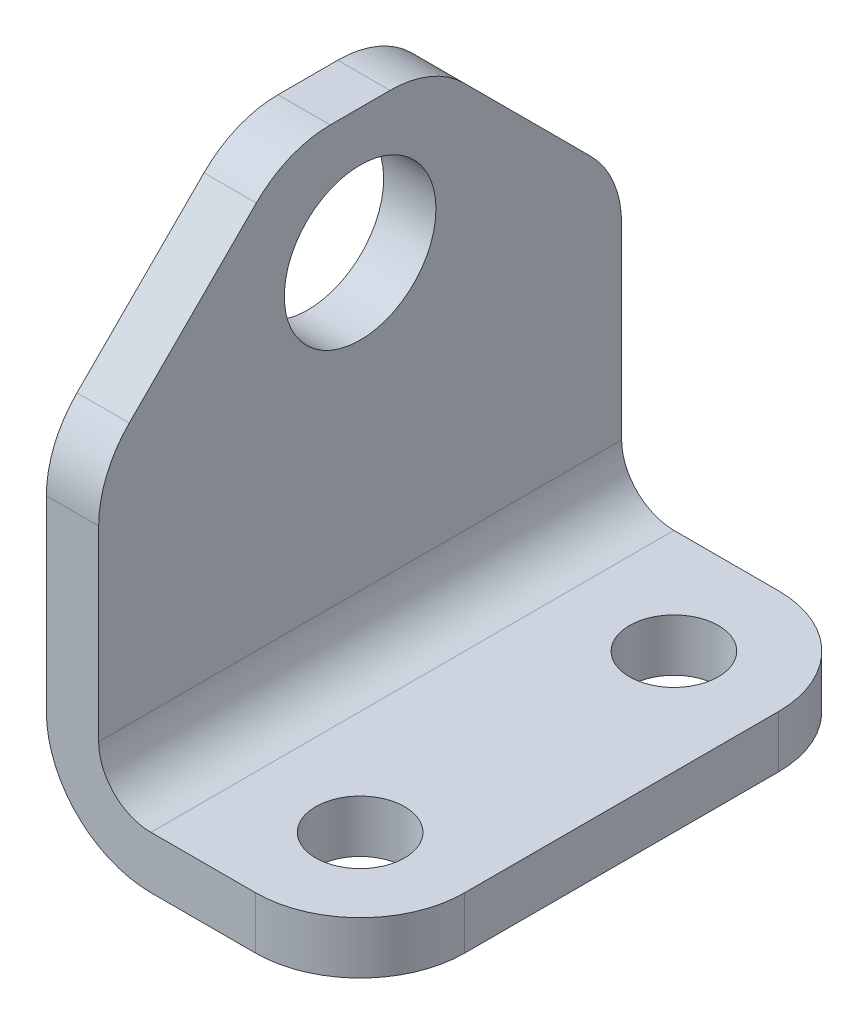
ISO-10303-21;
HEADER;
FILE_DESCRIPTION(('STEP AP214'),'2;1');
FILE_NAME('part.step','',(''),(''),'','','');
FILE_SCHEMA(('AUTOMOTIVE_DESIGN { 1 0 10303 214 1 1 1 1 }'));
ENDSEC;
DATA;
#1=APPLICATION_CONTEXT('core data for automotive mechanical design processes');
#2=APPLICATION_PROTOCOL_DEFINITION('international standard','automotive_design',2000,#1);
#3=PRODUCT_CONTEXT('',#1,'mechanical');
#4=PRODUCT('Part','Part','',(#3));
#5=PRODUCT_RELATED_PRODUCT_CATEGORY('part','',(#4));
#6=PRODUCT_DEFINITION_FORMATION('','',#4);
#7=PRODUCT_DEFINITION_CONTEXT('part definition',#1,'design');
#8=PRODUCT_DEFINITION('design','',#6,#7);
#9=PRODUCT_DEFINITION_SHAPE('','',#8);
#10=(LENGTH_UNIT() NAMED_UNIT(*) SI_UNIT(.MILLI.,.METRE.));
#11=(NAMED_UNIT(*) PLANE_ANGLE_UNIT() SI_UNIT($,.RADIAN.));
#12=(NAMED_UNIT(*) SI_UNIT($,.STERADIAN.) SOLID_ANGLE_UNIT());
#13=UNCERTAINTY_MEASURE_WITH_UNIT(LENGTH_MEASURE(1.E-05),#10,'distance_accuracy_value','');
#14=(GEOMETRIC_REPRESENTATION_CONTEXT(3) GLOBAL_UNCERTAINTY_ASSIGNED_CONTEXT((#13)) GLOBAL_UNIT_ASSIGNED_CONTEXT((#10,
#11,#12)) REPRESENTATION_CONTEXT('',''));
#15=CARTESIAN_POINT('',(0.,0.,0.));
#16=DIRECTION('',(0.,0.,1.));
#17=DIRECTION('',(1.,0.,0.));
#18=AXIS2_PLACEMENT_3D('',#15,#16,#17);
#19=CARTESIAN_POINT('',(0.,50.,50.));
#20=DIRECTION('',(1.,0.,0.));
#21=DIRECTION('',(0.,1.,0.));
#22=AXIS2_PLACEMENT_3D('',#19,#20,#21);
#23=PLANE('',#22);
#24=CARTESIAN_POINT('',(0.,38.,25.));
#25=DIRECTION('',(1.,0.,0.));
#26=DIRECTION('',(0.,0.,-1.));
#27=AXIS2_PLACEMENT_3D('',#24,#25,#26);
#28=CIRCLE('',#27,7.24999999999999);
#29=CARTESIAN_POINT('',(0.,38.,17.75));
#30=VERTEX_POINT('',#29);
#31=EDGE_CURVE('E324',#30,#30,#28,.T.);
#32=ORIENTED_EDGE('',*,*,#31,.T.);
#33=EDGE_LOOP('',(#32));
#34=FACE_BOUND('',#33,.T.);
#35=DIRECTION('',(0.,-1.,0.));
#36=VECTOR('',#35,1.);
#37=CARTESIAN_POINT('',(0.,50.,50.));
#38=LINE('',#37,#36);
#39=CARTESIAN_POINT('',(0.,27.8578643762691,50.));
#40=VERTEX_POINT('',#39);
#41=CARTESIAN_POINT('',(0.,9.99999999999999,50.));
#42=VERTEX_POINT('',#41);
#43=EDGE_CURVE('E177',#40,#42,#38,.T.);
#44=ORIENTED_EDGE('',*,*,#43,.F.);
#45=CARTESIAN_POINT('',(0.,27.8578643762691,40.));
#46=DIRECTION('',(1.,0.,0.));
#47=DIRECTION('',(0.,1.,0.));
#48=AXIS2_PLACEMENT_3D('',#45,#46,#47);
#49=CIRCLE('',#48,10.);
#50=CARTESIAN_POINT('',(0.,34.9289321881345,47.0710678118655));
#51=VERTEX_POINT('',#50);
#52=EDGE_CURVE('E256',#40,#51,#49,.F.);
#53=ORIENTED_EDGE('',*,*,#52,.T.);
#54=DIRECTION('',(0.,0.707106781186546,-0.707106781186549));
#55=VECTOR('',#54,1.);
#56=CARTESIAN_POINT('',(0.,32.,50.));
#57=LINE('',#56,#55);
#58=CARTESIAN_POINT('',(0.,47.0710678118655,34.9289321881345));
#59=VERTEX_POINT('',#58);
#60=EDGE_CURVE('E209',#51,#59,#57,.T.);
#61=ORIENTED_EDGE('',*,*,#60,.T.);
#62=CARTESIAN_POINT('',(0.,40.,27.857864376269));
#63=DIRECTION('',(1.,0.,0.));
#64=DIRECTION('',(0.,1.,0.));
#65=AXIS2_PLACEMENT_3D('',#62,#63,#64);
#66=CIRCLE('',#65,10.);
#67=CARTESIAN_POINT('',(0.,50.,27.857864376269));
#68=VERTEX_POINT('',#67);
#69=EDGE_CURVE('E250',#59,#68,#66,.F.);
#70=ORIENTED_EDGE('',*,*,#69,.T.);
#71=DIRECTION('',(0.,0.,-1.));
#72=VECTOR('',#71,1.);
#73=CARTESIAN_POINT('',(0.,50.,50.));
#74=LINE('',#73,#72);
#75=CARTESIAN_POINT('',(0.,50.,22.142135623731));
#76=VERTEX_POINT('',#75);
#77=EDGE_CURVE('E186',#68,#76,#74,.T.);
#78=ORIENTED_EDGE('',*,*,#77,.T.);
#79=CARTESIAN_POINT('',(0.,40.,22.142135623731));
#80=DIRECTION('',(1.,0.,0.));
#81=DIRECTION('',(0.,1.,0.));
#82=AXIS2_PLACEMENT_3D('',#79,#80,#81);
#83=CIRCLE('',#82,10.);
#84=CARTESIAN_POINT('',(0.,47.0710678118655,15.0710678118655));
#85=VERTEX_POINT('',#84);
#86=EDGE_CURVE('E252',#76,#85,#83,.F.);
#87=ORIENTED_EDGE('',*,*,#86,.T.);
#88=DIRECTION('',(0.,0.707106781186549,0.707106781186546));
#89=VECTOR('',#88,1.);
#90=CARTESIAN_POINT('',(0.,50.,18.));
#91=LINE('',#90,#89);
#92=CARTESIAN_POINT('',(0.,34.9289321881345,2.92893218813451));
#93=VERTEX_POINT('',#92);
#94=EDGE_CURVE('E221',#85,#93,#91,.F.);
#95=ORIENTED_EDGE('',*,*,#94,.T.);
#96=CARTESIAN_POINT('',(0.,27.857864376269,10.));
#97=DIRECTION('',(1.,0.,0.));
#98=DIRECTION('',(0.,1.,0.));
#99=AXIS2_PLACEMENT_3D('',#96,#97,#98);
#100=CIRCLE('',#99,10.);
#101=CARTESIAN_POINT('',(0.,27.857864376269,0.));
#102=VERTEX_POINT('',#101);
#103=EDGE_CURVE('E254',#93,#102,#100,.F.);
#104=ORIENTED_EDGE('',*,*,#103,.T.);
#105=DIRECTION('',(0.,-1.,0.));
#106=VECTOR('',#105,1.);
#107=CARTESIAN_POINT('',(0.,50.,0.));
#108=LINE('',#107,#106);
#109=CARTESIAN_POINT('',(0.,9.99999999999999,0.));
#110=VERTEX_POINT('',#109);
#111=EDGE_CURVE('E213',#102,#110,#108,.T.);
#112=ORIENTED_EDGE('',*,*,#111,.T.);
#113=DIRECTION('',(0.,0.,-1.));
#114=VECTOR('',#113,1.);
#115=CARTESIAN_POINT('',(0.,9.99999999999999,50.));
#116=LINE('',#115,#114);
#117=EDGE_CURVE('E204',#110,#42,#116,.F.);
#118=ORIENTED_EDGE('',*,*,#117,.T.);
#119=EDGE_LOOP('',(#44,#53,#61,#70,#78,#87,#95,#104,#112,#118));
#120=FACE_BOUND('',#119,.T.);
#121=ADVANCED_FACE('F34',(#34,#120),#23,.F.);
#122=CARTESIAN_POINT('',(0.,0.,50.));
#123=DIRECTION('',(0.,1.,0.));
#124=DIRECTION('',(0.,0.,1.));
#125=AXIS2_PLACEMENT_3D('',#122,#123,#124);
#126=PLANE('',#125);
#127=CARTESIAN_POINT('',(20.,0.,10.));
#128=DIRECTION('',(0.,-1.,0.));
#129=DIRECTION('',(0.,0.,-1.));
#130=AXIS2_PLACEMENT_3D('',#127,#128,#129);
#131=CIRCLE('',#130,4.25);
#132=CARTESIAN_POINT('',(20.,0.,5.75));
#133=VERTEX_POINT('',#132);
#134=EDGE_CURVE('E218',#133,#133,#131,.T.);
#135=ORIENTED_EDGE('',*,*,#134,.F.);
#136=EDGE_LOOP('',(#135));
#137=FACE_BOUND('',#136,.T.);
#138=CARTESIAN_POINT('',(20.,0.,40.));
#139=DIRECTION('',(0.,-1.,0.));
#140=DIRECTION('',(0.,0.,-1.));
#141=AXIS2_PLACEMENT_3D('',#138,#139,#140);
#142=CIRCLE('',#141,4.25);
#143=CARTESIAN_POINT('',(20.,0.,35.75));
#144=VERTEX_POINT('',#143);
#145=EDGE_CURVE('E214',#144,#144,#142,.T.);
#146=ORIENTED_EDGE('',*,*,#145,.F.);
#147=EDGE_LOOP('',(#146));
#148=FACE_BOUND('',#147,.T.);
#149=DIRECTION('',(1.,0.,0.));
#150=VECTOR('',#149,1.);
#151=CARTESIAN_POINT('',(0.,0.,0.));
#152=LINE('',#151,#150);
#153=CARTESIAN_POINT('',(10.,0.,0.));
#154=VERTEX_POINT('',#153);
#155=CARTESIAN_POINT('',(20.,0.,0.));
#156=VERTEX_POINT('',#155);
#157=EDGE_CURVE('E182',#154,#156,#152,.T.);
#158=ORIENTED_EDGE('',*,*,#157,.T.);
#159=CARTESIAN_POINT('',(20.,0.,10.));
#160=DIRECTION('',(0.,1.,0.));
#161=DIRECTION('',(0.,0.,1.));
#162=AXIS2_PLACEMENT_3D('',#159,#160,#161);
#163=CIRCLE('',#162,10.);
#164=CARTESIAN_POINT('',(30.,0.,10.));
#165=VERTEX_POINT('',#164);
#166=EDGE_CURVE('E242',#156,#165,#163,.F.);
#167=ORIENTED_EDGE('',*,*,#166,.T.);
#168=DIRECTION('',(0.,0.,-1.));
#169=VECTOR('',#168,1.);
#170=CARTESIAN_POINT('',(30.,0.,50.));
#171=LINE('',#170,#169);
#172=CARTESIAN_POINT('',(30.,0.,40.));
#173=VERTEX_POINT('',#172);
#174=EDGE_CURVE('E170',#173,#165,#171,.T.);
#175=ORIENTED_EDGE('',*,*,#174,.F.);
#176=CARTESIAN_POINT('',(20.,0.,40.));
#177=DIRECTION('',(0.,1.,0.));
#178=DIRECTION('',(0.,0.,1.));
#179=AXIS2_PLACEMENT_3D('',#176,#177,#178);
#180=CIRCLE('',#179,10.);
#181=CARTESIAN_POINT('',(20.,0.,50.));
#182=VERTEX_POINT('',#181);
#183=EDGE_CURVE('E240',#173,#182,#180,.F.);
#184=ORIENTED_EDGE('',*,*,#183,.T.);
#185=DIRECTION('',(1.,0.,0.));
#186=VECTOR('',#185,1.);
#187=CARTESIAN_POINT('',(0.,0.,50.));
#188=LINE('',#187,#186);
#189=CARTESIAN_POINT('',(10.,0.,50.));
#190=VERTEX_POINT('',#189);
#191=EDGE_CURVE('E180',#190,#182,#188,.T.);
#192=ORIENTED_EDGE('',*,*,#191,.F.);
#193=DIRECTION('',(0.,0.,-1.));
#194=VECTOR('',#193,1.);
#195=CARTESIAN_POINT('',(10.,0.,50.));
#196=LINE('',#195,#194);
#197=EDGE_CURVE('E198',#190,#154,#196,.T.);
#198=ORIENTED_EDGE('',*,*,#197,.T.);
#199=EDGE_LOOP('',(#158,#167,#175,#184,#192,#198));
#200=FACE_BOUND('',#199,.T.);
#201=ADVANCED_FACE('F299',(#137,#148,#200),#126,.F.);
#202=CARTESIAN_POINT('',(30.,5.,50.));
#203=DIRECTION('',(-1.,0.,0.));
#204=DIRECTION('',(0.,-1.,0.));
#205=AXIS2_PLACEMENT_3D('',#202,#203,#204);
#206=PLANE('',#205);
#207=ORIENTED_EDGE('',*,*,#174,.T.);
#208=DIRECTION('',(0.,1.,0.));
#209=VECTOR('',#208,1.);
#210=CARTESIAN_POINT('',(30.,5.,10.));
#211=LINE('',#210,#209);
#212=CARTESIAN_POINT('',(30.,5.,10.));
#213=VERTEX_POINT('',#212);
#214=EDGE_CURVE('E230',#165,#213,#211,.T.);
#215=ORIENTED_EDGE('',*,*,#214,.T.);
#216=DIRECTION('',(0.,0.,-1.));
#217=VECTOR('',#216,1.);
#218=CARTESIAN_POINT('',(30.,5.,50.));
#219=LINE('',#218,#217);
#220=CARTESIAN_POINT('',(30.,5.,40.));
#221=VERTEX_POINT('',#220);
#222=EDGE_CURVE('E191',#221,#213,#219,.T.);
#223=ORIENTED_EDGE('',*,*,#222,.F.);
#224=DIRECTION('',(0.,1.,0.));
#225=VECTOR('',#224,1.);
#226=CARTESIAN_POINT('',(30.,0.,40.));
#227=LINE('',#226,#225);
#228=EDGE_CURVE('E228',#221,#173,#227,.F.);
#229=ORIENTED_EDGE('',*,*,#228,.T.);
#230=EDGE_LOOP('',(#207,#215,#223,#229));
#231=FACE_BOUND('',#230,.T.);
#232=ADVANCED_FACE('F309',(#231),#206,.F.);
#233=CARTESIAN_POINT('',(5.,5.,50.));
#234=DIRECTION('',(0.,-1.,0.));
#235=DIRECTION('',(0.,0.,-1.));
#236=AXIS2_PLACEMENT_3D('',#233,#234,#235);
#237=PLANE('',#236);
#238=CARTESIAN_POINT('',(20.,5.,10.));
#239=DIRECTION('',(0.,-1.,0.));
#240=DIRECTION('',(0.,0.,-1.));
#241=AXIS2_PLACEMENT_3D('',#238,#239,#240);
#242=CIRCLE('',#241,4.25);
#243=CARTESIAN_POINT('',(20.,5.,5.75));
#244=VERTEX_POINT('',#243);
#245=EDGE_CURVE('E215',#244,#244,#242,.T.);
#246=ORIENTED_EDGE('',*,*,#245,.T.);
#247=EDGE_LOOP('',(#246));
#248=FACE_BOUND('',#247,.T.);
#249=CARTESIAN_POINT('',(20.,5.,40.));
#250=DIRECTION('',(0.,-1.,0.));
#251=DIRECTION('',(0.,0.,-1.));
#252=AXIS2_PLACEMENT_3D('',#249,#250,#251);
#253=CIRCLE('',#252,4.25);
#254=CARTESIAN_POINT('',(20.,5.,35.75));
#255=VERTEX_POINT('',#254);
#256=EDGE_CURVE('E210',#255,#255,#253,.T.);
#257=ORIENTED_EDGE('',*,*,#256,.T.);
#258=EDGE_LOOP('',(#257));
#259=FACE_BOUND('',#258,.T.);
#260=ORIENTED_EDGE('',*,*,#222,.T.);
#261=CARTESIAN_POINT('',(20.,5.,10.));
#262=DIRECTION('',(0.,-1.,0.));
#263=DIRECTION('',(0.,0.,-1.));
#264=AXIS2_PLACEMENT_3D('',#261,#262,#263);
#265=CIRCLE('',#264,10.);
#266=CARTESIAN_POINT('',(20.,5.,0.));
#267=VERTEX_POINT('',#266);
#268=EDGE_CURVE('E235',#213,#267,#265,.F.);
#269=ORIENTED_EDGE('',*,*,#268,.T.);
#270=DIRECTION('',(-1.,0.,0.));
#271=VECTOR('',#270,1.);
#272=CARTESIAN_POINT('',(5.,5.,0.));
#273=LINE('',#272,#271);
#274=CARTESIAN_POINT('',(10.,5.,0.));
#275=VERTEX_POINT('',#274);
#276=EDGE_CURVE('E178',#267,#275,#273,.T.);
#277=ORIENTED_EDGE('',*,*,#276,.T.);
#278=DIRECTION('',(0.,0.,-1.));
#279=VECTOR('',#278,1.);
#280=CARTESIAN_POINT('',(10.,5.,50.));
#281=LINE('',#280,#279);
#282=CARTESIAN_POINT('',(10.,5.,50.));
#283=VERTEX_POINT('',#282);
#284=EDGE_CURVE('E157',#275,#283,#281,.F.);
#285=ORIENTED_EDGE('',*,*,#284,.T.);
#286=DIRECTION('',(-1.,0.,0.));
#287=VECTOR('',#286,1.);
#288=CARTESIAN_POINT('',(5.,5.,50.));
#289=LINE('',#288,#287);
#290=CARTESIAN_POINT('',(20.,5.,50.));
#291=VERTEX_POINT('',#290);
#292=EDGE_CURVE('E290',#291,#283,#289,.T.);
#293=ORIENTED_EDGE('',*,*,#292,.F.);
#294=CARTESIAN_POINT('',(20.,5.,40.));
#295=DIRECTION('',(0.,-1.,0.));
#296=DIRECTION('',(0.,0.,-1.));
#297=AXIS2_PLACEMENT_3D('',#294,#295,#296);
#298=CIRCLE('',#297,10.);
#299=EDGE_CURVE('E233',#291,#221,#298,.F.);
#300=ORIENTED_EDGE('',*,*,#299,.T.);
#301=EDGE_LOOP('',(#260,#269,#277,#285,#293,#300));
#302=FACE_BOUND('',#301,.T.);
#303=ADVANCED_FACE('F312',(#248,#259,#302),#237,.F.);
#304=CARTESIAN_POINT('',(4.99999999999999,50.,50.));
#305=DIRECTION('',(-1.,0.,0.));
#306=DIRECTION('',(0.,-1.,0.));
#307=AXIS2_PLACEMENT_3D('',#304,#305,#306);
#308=PLANE('',#307);
#309=CARTESIAN_POINT('',(5.,38.,25.));
#310=DIRECTION('',(1.,0.,0.));
#311=DIRECTION('',(0.,0.,-1.));
#312=AXIS2_PLACEMENT_3D('',#309,#310,#311);
#313=CIRCLE('',#312,7.24999999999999);
#314=CARTESIAN_POINT('',(5.,38.,17.75));
#315=VERTEX_POINT('',#314);
#316=EDGE_CURVE('E327',#315,#315,#313,.T.);
#317=ORIENTED_EDGE('',*,*,#316,.F.);
#318=EDGE_LOOP('',(#317));
#319=FACE_BOUND('',#318,.T.);
#320=DIRECTION('',(0.,-0.707106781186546,0.707106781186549));
#321=VECTOR('',#320,1.);
#322=CARTESIAN_POINT('',(5.,32.,50.));
#323=LINE('',#322,#321);
#324=CARTESIAN_POINT('',(4.99999999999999,47.0710678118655,34.9289321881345));
#325=VERTEX_POINT('',#324);
#326=CARTESIAN_POINT('',(5.,34.9289321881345,47.0710678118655));
#327=VERTEX_POINT('',#326);
#328=EDGE_CURVE('E224',#325,#327,#323,.T.);
#329=ORIENTED_EDGE('',*,*,#328,.T.);
#330=CARTESIAN_POINT('',(5.,27.8578643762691,40.));
#331=DIRECTION('',(-1.,0.,0.));
#332=DIRECTION('',(0.,-1.,0.));
#333=AXIS2_PLACEMENT_3D('',#330,#331,#332);
#334=CIRCLE('',#333,10.);
#335=CARTESIAN_POINT('',(5.,27.8578643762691,50.));
#336=VERTEX_POINT('',#335);
#337=EDGE_CURVE('E266',#327,#336,#334,.F.);
#338=ORIENTED_EDGE('',*,*,#337,.T.);
#339=DIRECTION('',(0.,1.,0.));
#340=VECTOR('',#339,1.);
#341=CARTESIAN_POINT('',(4.99999999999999,50.,50.));
#342=LINE('',#341,#340);
#343=CARTESIAN_POINT('',(5.,10.,50.));
#344=VERTEX_POINT('',#343);
#345=EDGE_CURVE('E169',#344,#336,#342,.T.);
#346=ORIENTED_EDGE('',*,*,#345,.F.);
#347=DIRECTION('',(0.,0.,-1.));
#348=VECTOR('',#347,1.);
#349=CARTESIAN_POINT('',(5.,10.,0.));
#350=LINE('',#349,#348);
#351=CARTESIAN_POINT('',(5.,10.,0.));
#352=VERTEX_POINT('',#351);
#353=EDGE_CURVE('E155',#344,#352,#350,.T.);
#354=ORIENTED_EDGE('',*,*,#353,.T.);
#355=DIRECTION('',(0.,1.,0.));
#356=VECTOR('',#355,1.);
#357=CARTESIAN_POINT('',(4.99999999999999,50.,0.));
#358=LINE('',#357,#356);
#359=CARTESIAN_POINT('',(5.,27.857864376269,0.));
#360=VERTEX_POINT('',#359);
#361=EDGE_CURVE('E167',#352,#360,#358,.T.);
#362=ORIENTED_EDGE('',*,*,#361,.T.);
#363=CARTESIAN_POINT('',(5.,27.857864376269,10.));
#364=DIRECTION('',(-1.,0.,0.));
#365=DIRECTION('',(0.,-1.,0.));
#366=AXIS2_PLACEMENT_3D('',#363,#364,#365);
#367=CIRCLE('',#366,10.);
#368=CARTESIAN_POINT('',(5.,34.9289321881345,2.92893218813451));
#369=VERTEX_POINT('',#368);
#370=EDGE_CURVE('E264',#360,#369,#367,.F.);
#371=ORIENTED_EDGE('',*,*,#370,.T.);
#372=DIRECTION('',(0.,-0.707106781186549,-0.707106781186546));
#373=VECTOR('',#372,1.);
#374=CARTESIAN_POINT('',(4.99999999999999,50.,18.));
#375=LINE('',#374,#373);
#376=CARTESIAN_POINT('',(4.99999999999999,47.0710678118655,15.0710678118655));
#377=VERTEX_POINT('',#376);
#378=EDGE_CURVE('E226',#369,#377,#375,.F.);
#379=ORIENTED_EDGE('',*,*,#378,.T.);
#380=CARTESIAN_POINT('',(4.99999999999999,40.,22.142135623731));
#381=DIRECTION('',(-1.,0.,0.));
#382=DIRECTION('',(0.,-1.,0.));
#383=AXIS2_PLACEMENT_3D('',#380,#381,#382);
#384=CIRCLE('',#383,10.);
#385=CARTESIAN_POINT('',(4.99999999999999,50.,22.142135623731));
#386=VERTEX_POINT('',#385);
#387=EDGE_CURVE('E49',#377,#386,#384,.F.);
#388=ORIENTED_EDGE('',*,*,#387,.T.);
#389=DIRECTION('',(0.,0.,-1.));
#390=VECTOR('',#389,1.);
#391=CARTESIAN_POINT('',(4.99999999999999,50.,50.));
#392=LINE('',#391,#390);
#393=CARTESIAN_POINT('',(4.99999999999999,50.,27.857864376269));
#394=VERTEX_POINT('',#393);
#395=EDGE_CURVE('E189',#394,#386,#392,.T.);
#396=ORIENTED_EDGE('',*,*,#395,.F.);
#397=CARTESIAN_POINT('',(4.99999999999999,40.,27.857864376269));
#398=DIRECTION('',(-1.,0.,0.));
#399=DIRECTION('',(0.,-1.,0.));
#400=AXIS2_PLACEMENT_3D('',#397,#398,#399);
#401=CIRCLE('',#400,10.);
#402=EDGE_CURVE('E57',#394,#325,#401,.F.);
#403=ORIENTED_EDGE('',*,*,#402,.T.);
#404=EDGE_LOOP('',(#329,#338,#346,#354,#362,#371,#379,#388,#396,#403));
#405=FACE_BOUND('',#404,.T.);
#406=ADVANCED_FACE('F166',(#319,#405),#308,.F.);
#407=CARTESIAN_POINT('',(0.,50.,50.));
#408=DIRECTION('',(0.,-1.,0.));
#409=DIRECTION('',(0.,0.,-1.));
#410=AXIS2_PLACEMENT_3D('',#407,#408,#409);
#411=PLANE('',#410);
#412=ORIENTED_EDGE('',*,*,#395,.T.);
#413=DIRECTION('',(1.,0.,0.));
#414=VECTOR('',#413,1.);
#415=CARTESIAN_POINT('',(0.,50.,22.142135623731));
#416=LINE('',#415,#414);
#417=EDGE_CURVE('E11',#386,#76,#416,.F.);
#418=ORIENTED_EDGE('',*,*,#417,.T.);
#419=ORIENTED_EDGE('',*,*,#77,.F.);
#420=DIRECTION('',(1.,0.,0.));
#421=VECTOR('',#420,1.);
#422=CARTESIAN_POINT('',(4.99999999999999,50.,27.857864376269));
#423=LINE('',#422,#421);
#424=EDGE_CURVE('E42',#68,#394,#423,.T.);
#425=ORIENTED_EDGE('',*,*,#424,.T.);
#426=EDGE_LOOP('',(#412,#418,#419,#425));
#427=FACE_BOUND('',#426,.T.);
#428=ADVANCED_FACE('F273',(#427),#411,.F.);
#429=CARTESIAN_POINT('',(0.,0.,50.));
#430=DIRECTION('',(0.,0.,1.));
#431=DIRECTION('',(1.,0.,0.));
#432=AXIS2_PLACEMENT_3D('',#429,#430,#431);
#433=PLANE('',#432);
#434=ORIENTED_EDGE('',*,*,#191,.T.);
#435=DIRECTION('',(0.,1.,0.));
#436=VECTOR('',#435,1.);
#437=CARTESIAN_POINT('',(20.,4.99999999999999,50.));
#438=LINE('',#437,#436);
#439=EDGE_CURVE('E247',#182,#291,#438,.T.);
#440=ORIENTED_EDGE('',*,*,#439,.T.);
#441=ORIENTED_EDGE('',*,*,#292,.T.);
#442=CARTESIAN_POINT('',(10.,10.,50.));
#443=DIRECTION('',(0.,0.,1.));
#444=DIRECTION('',(1.,0.,0.));
#445=AXIS2_PLACEMENT_3D('',#442,#443,#444);
#446=CIRCLE('',#445,5.);
#447=EDGE_CURVE('E161',#283,#344,#446,.F.);
#448=ORIENTED_EDGE('',*,*,#447,.T.);
#449=ORIENTED_EDGE('',*,*,#345,.T.);
#450=DIRECTION('',(-1.,0.,0.));
#451=VECTOR('',#450,1.);
#452=CARTESIAN_POINT('',(0.,27.8578643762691,50.));
#453=LINE('',#452,#451);
#454=EDGE_CURVE('E244',#336,#40,#453,.T.);
#455=ORIENTED_EDGE('',*,*,#454,.T.);
#456=ORIENTED_EDGE('',*,*,#43,.T.);
#457=CARTESIAN_POINT('',(10.,10.,50.));
#458=DIRECTION('',(0.,0.,1.));
#459=DIRECTION('',(1.,0.,0.));
#460=AXIS2_PLACEMENT_3D('',#457,#458,#459);
#461=CIRCLE('',#460,10.);
#462=EDGE_CURVE('E207',#42,#190,#461,.T.);
#463=ORIENTED_EDGE('',*,*,#462,.T.);
#464=EDGE_LOOP('',(#434,#440,#441,#448,#449,#455,#456,#463));
#465=FACE_BOUND('',#464,.T.);
#466=ADVANCED_FACE('F289',(#465),#433,.T.);
#467=CARTESIAN_POINT('',(0.,0.,0.));
#468=DIRECTION('',(0.,0.,1.));
#469=DIRECTION('',(1.,0.,0.));
#470=AXIS2_PLACEMENT_3D('',#467,#468,#469);
#471=PLANE('',#470);
#472=ORIENTED_EDGE('',*,*,#276,.F.);
#473=DIRECTION('',(0.,1.,0.));
#474=VECTOR('',#473,1.);
#475=CARTESIAN_POINT('',(20.,0.,0.));
#476=LINE('',#475,#474);
#477=EDGE_CURVE('E238',#267,#156,#476,.F.);
#478=ORIENTED_EDGE('',*,*,#477,.T.);
#479=ORIENTED_EDGE('',*,*,#157,.F.);
#480=CARTESIAN_POINT('',(10.,10.,0.));
#481=DIRECTION('',(0.,0.,1.));
#482=DIRECTION('',(1.,0.,0.));
#483=AXIS2_PLACEMENT_3D('',#480,#481,#482);
#484=CIRCLE('',#483,10.);
#485=EDGE_CURVE('E201',#154,#110,#484,.F.);
#486=ORIENTED_EDGE('',*,*,#485,.T.);
#487=ORIENTED_EDGE('',*,*,#111,.F.);
#488=DIRECTION('',(-1.,0.,0.));
#489=VECTOR('',#488,1.);
#490=CARTESIAN_POINT('',(5.,27.857864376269,0.));
#491=LINE('',#490,#489);
#492=EDGE_CURVE('E176',#102,#360,#491,.F.);
#493=ORIENTED_EDGE('',*,*,#492,.T.);
#494=ORIENTED_EDGE('',*,*,#361,.F.);
#495=CARTESIAN_POINT('',(10.,10.,0.));
#496=DIRECTION('',(0.,0.,1.));
#497=DIRECTION('',(1.,0.,0.));
#498=AXIS2_PLACEMENT_3D('',#495,#496,#497);
#499=CIRCLE('',#498,5.);
#500=EDGE_CURVE('E151',#352,#275,#499,.T.);
#501=ORIENTED_EDGE('',*,*,#500,.T.);
#502=EDGE_LOOP('',(#472,#478,#479,#486,#487,#493,#494,#501));
#503=FACE_BOUND('',#502,.T.);
#504=ADVANCED_FACE('F173',(#503),#471,.F.);
#505=CARTESIAN_POINT('',(10.,10.,50.));
#506=DIRECTION('',(0.,0.,1.));
#507=DIRECTION('',(1.,0.,0.));
#508=AXIS2_PLACEMENT_3D('',#505,#506,#507);
#509=CYLINDRICAL_SURFACE('',#508,5.);
#510=ORIENTED_EDGE('',*,*,#447,.F.);
#511=ORIENTED_EDGE('',*,*,#284,.F.);
#512=ORIENTED_EDGE('',*,*,#500,.F.);
#513=ORIENTED_EDGE('',*,*,#353,.F.);
#514=EDGE_LOOP('',(#510,#511,#512,#513));
#515=FACE_BOUND('',#514,.T.);
#516=ADVANCED_FACE('F154',(#515),#509,.F.);
#517=CARTESIAN_POINT('',(10.,10.,50.));
#518=DIRECTION('',(0.,0.,-1.));
#519=DIRECTION('',(-1.,0.,0.));
#520=AXIS2_PLACEMENT_3D('',#517,#518,#519);
#521=CYLINDRICAL_SURFACE('',#520,10.);
#522=ORIENTED_EDGE('',*,*,#462,.F.);
#523=ORIENTED_EDGE('',*,*,#117,.F.);
#524=ORIENTED_EDGE('',*,*,#485,.F.);
#525=ORIENTED_EDGE('',*,*,#197,.F.);
#526=EDGE_LOOP('',(#522,#523,#524,#525));
#527=FACE_BOUND('',#526,.T.);
#528=ADVANCED_FACE('F354',(#527),#521,.T.);
#529=CARTESIAN_POINT('',(20.,50.,40.));
#530=DIRECTION('',(0.,-1.,0.));
#531=DIRECTION('',(0.,0.,-1.));
#532=AXIS2_PLACEMENT_3D('',#529,#530,#531);
#533=CYLINDRICAL_SURFACE('',#532,4.25);
#534=ORIENTED_EDGE('',*,*,#145,.T.);
#535=EDGE_LOOP('',(#534));
#536=FACE_BOUND('',#535,.T.);
#537=ORIENTED_EDGE('',*,*,#256,.F.);
#538=EDGE_LOOP('',(#537));
#539=FACE_BOUND('',#538,.T.);
#540=ADVANCED_FACE('F357',(#536,#539),#533,.F.);
#541=CARTESIAN_POINT('',(20.,50.,10.));
#542=DIRECTION('',(0.,-1.,0.));
#543=DIRECTION('',(0.,0.,-1.));
#544=AXIS2_PLACEMENT_3D('',#541,#542,#543);
#545=CYLINDRICAL_SURFACE('',#544,4.25);
#546=ORIENTED_EDGE('',*,*,#134,.T.);
#547=EDGE_LOOP('',(#546));
#548=FACE_BOUND('',#547,.T.);
#549=ORIENTED_EDGE('',*,*,#245,.F.);
#550=EDGE_LOOP('',(#549));
#551=FACE_BOUND('',#550,.T.);
#552=ADVANCED_FACE('F488',(#548,#551),#545,.F.);
#553=CARTESIAN_POINT('',(5.,38.,25.));
#554=DIRECTION('',(1.,0.,0.));
#555=DIRECTION('',(0.,0.,-1.));
#556=AXIS2_PLACEMENT_3D('',#553,#554,#555);
#557=CYLINDRICAL_SURFACE('',#556,7.24999999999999);
#558=ORIENTED_EDGE('',*,*,#31,.F.);
#559=EDGE_LOOP('',(#558));
#560=FACE_BOUND('',#559,.T.);
#561=ORIENTED_EDGE('',*,*,#316,.T.);
#562=EDGE_LOOP('',(#561));
#563=FACE_BOUND('',#562,.T.);
#564=ADVANCED_FACE('F331',(#560,#563),#557,.F.);
#565=CARTESIAN_POINT('',(0.,50.,18.));
#566=DIRECTION('',(0.,-0.707106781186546,0.707106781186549));
#567=DIRECTION('',(-1.,0.,0.));
#568=AXIS2_PLACEMENT_3D('',#565,#566,#567);
#569=PLANE('',#568);
#570=ORIENTED_EDGE('',*,*,#378,.F.);
#571=DIRECTION('',(1.,0.,0.));
#572=VECTOR('',#571,1.);
#573=CARTESIAN_POINT('',(0.,34.9289321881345,2.92893218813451));
#574=LINE('',#573,#572);
#575=EDGE_CURVE('E270',#369,#93,#574,.F.);
#576=ORIENTED_EDGE('',*,*,#575,.T.);
#577=ORIENTED_EDGE('',*,*,#94,.F.);
#578=DIRECTION('',(-1.,0.,0.));
#579=VECTOR('',#578,1.);
#580=CARTESIAN_POINT('',(4.99999999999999,47.0710678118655,15.0710678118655));
#581=LINE('',#580,#579);
#582=EDGE_CURVE('E268',#85,#377,#581,.F.);
#583=ORIENTED_EDGE('',*,*,#582,.T.);
#584=EDGE_LOOP('',(#570,#576,#577,#583));
#585=FACE_BOUND('',#584,.T.);
#586=ADVANCED_FACE('F359',(#585),#569,.F.);
#587=CARTESIAN_POINT('',(0.,32.,50.));
#588=DIRECTION('',(0.,0.707106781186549,0.707106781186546));
#589=DIRECTION('',(1.,0.,0.));
#590=AXIS2_PLACEMENT_3D('',#587,#588,#589);
#591=PLANE('',#590);
#592=ORIENTED_EDGE('',*,*,#60,.F.);
#593=DIRECTION('',(-1.,0.,0.));
#594=VECTOR('',#593,1.);
#595=CARTESIAN_POINT('',(0.,34.9289321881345,47.0710678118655));
#596=LINE('',#595,#594);
#597=EDGE_CURVE('E260',#51,#327,#596,.F.);
#598=ORIENTED_EDGE('',*,*,#597,.T.);
#599=ORIENTED_EDGE('',*,*,#328,.F.);
#600=DIRECTION('',(1.,0.,0.));
#601=VECTOR('',#600,1.);
#602=CARTESIAN_POINT('',(0.,47.0710678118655,34.9289321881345));
#603=LINE('',#602,#601);
#604=EDGE_CURVE('E258',#325,#59,#603,.F.);
#605=ORIENTED_EDGE('',*,*,#604,.T.);
#606=EDGE_LOOP('',(#592,#598,#599,#605));
#607=FACE_BOUND('',#606,.T.);
#608=ADVANCED_FACE('F280',(#607),#591,.T.);
#609=CARTESIAN_POINT('',(20.,4.99999999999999,10.));
#610=DIRECTION('',(0.,1.,0.));
#611=DIRECTION('',(-1.,0.,0.));
#612=AXIS2_PLACEMENT_3D('',#609,#610,#611);
#613=CYLINDRICAL_SURFACE('',#612,10.);
#614=ORIENTED_EDGE('',*,*,#166,.F.);
#615=ORIENTED_EDGE('',*,*,#477,.F.);
#616=ORIENTED_EDGE('',*,*,#268,.F.);
#617=ORIENTED_EDGE('',*,*,#214,.F.);
#618=EDGE_LOOP('',(#614,#615,#616,#617));
#619=FACE_BOUND('',#618,.T.);
#620=ADVANCED_FACE('F306',(#619),#613,.T.);
#621=CARTESIAN_POINT('',(20.,0.,40.));
#622=DIRECTION('',(0.,-1.,0.));
#623=DIRECTION('',(1.,0.,0.));
#624=AXIS2_PLACEMENT_3D('',#621,#622,#623);
#625=CYLINDRICAL_SURFACE('',#624,10.);
#626=ORIENTED_EDGE('',*,*,#183,.F.);
#627=ORIENTED_EDGE('',*,*,#228,.F.);
#628=ORIENTED_EDGE('',*,*,#299,.F.);
#629=ORIENTED_EDGE('',*,*,#439,.F.);
#630=EDGE_LOOP('',(#626,#627,#628,#629));
#631=FACE_BOUND('',#630,.T.);
#632=ADVANCED_FACE('F317',(#631),#625,.T.);
#633=CARTESIAN_POINT('',(0.,27.8578643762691,40.));
#634=DIRECTION('',(-1.,0.,0.));
#635=DIRECTION('',(0.,0.,1.));
#636=AXIS2_PLACEMENT_3D('',#633,#634,#635);
#637=CYLINDRICAL_SURFACE('',#636,10.);
#638=ORIENTED_EDGE('',*,*,#337,.F.);
#639=ORIENTED_EDGE('',*,*,#597,.F.);
#640=ORIENTED_EDGE('',*,*,#52,.F.);
#641=ORIENTED_EDGE('',*,*,#454,.F.);
#642=EDGE_LOOP('',(#638,#639,#640,#641));
#643=FACE_BOUND('',#642,.T.);
#644=ADVANCED_FACE('F285',(#643),#637,.T.);
#645=CARTESIAN_POINT('',(0.,27.857864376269,10.));
#646=DIRECTION('',(1.,0.,0.));
#647=DIRECTION('',(0.,0.,-1.));
#648=AXIS2_PLACEMENT_3D('',#645,#646,#647);
#649=CYLINDRICAL_SURFACE('',#648,10.);
#650=ORIENTED_EDGE('',*,*,#103,.F.);
#651=ORIENTED_EDGE('',*,*,#575,.F.);
#652=ORIENTED_EDGE('',*,*,#370,.F.);
#653=ORIENTED_EDGE('',*,*,#492,.F.);
#654=EDGE_LOOP('',(#650,#651,#652,#653));
#655=FACE_BOUND('',#654,.T.);
#656=ADVANCED_FACE('F371',(#655),#649,.T.);
#657=CARTESIAN_POINT('',(0.,40.,22.142135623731));
#658=DIRECTION('',(-1.,0.,0.));
#659=DIRECTION('',(0.,0.,1.));
#660=AXIS2_PLACEMENT_3D('',#657,#658,#659);
#661=CYLINDRICAL_SURFACE('',#660,10.);
#662=ORIENTED_EDGE('',*,*,#387,.F.);
#663=ORIENTED_EDGE('',*,*,#582,.F.);
#664=ORIENTED_EDGE('',*,*,#86,.F.);
#665=ORIENTED_EDGE('',*,*,#417,.F.);
#666=EDGE_LOOP('',(#662,#663,#664,#665));
#667=FACE_BOUND('',#666,.T.);
#668=ADVANCED_FACE('F373',(#667),#661,.T.);
#669=CARTESIAN_POINT('',(0.,40.,27.857864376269));
#670=DIRECTION('',(-1.,0.,0.));
#671=DIRECTION('',(0.,0.,1.));
#672=AXIS2_PLACEMENT_3D('',#669,#670,#671);
#673=CYLINDRICAL_SURFACE('',#672,10.);
#674=ORIENTED_EDGE('',*,*,#69,.F.);
#675=ORIENTED_EDGE('',*,*,#604,.F.);
#676=ORIENTED_EDGE('',*,*,#402,.F.);
#677=ORIENTED_EDGE('',*,*,#424,.F.);
#678=EDGE_LOOP('',(#674,#675,#676,#677));
#679=FACE_BOUND('',#678,.T.);
#680=ADVANCED_FACE('F36',(#679),#673,.T.);
#681=CLOSED_SHELL('',(#121,#201,#232,#303,#406,#428,#466,#504,#516,#528,#540,#552,#564,#586,
#608,#620,#632,#644,#656,#668,#680));
#682=MANIFOLD_SOLID_BREP('B2',#681);
#683=ADVANCED_BREP_SHAPE_REPRESENTATION('',(#18,#682),#14);
#684=SHAPE_DEFINITION_REPRESENTATION(#9,#683);
ENDSEC;
END-ISO-10303-21;
